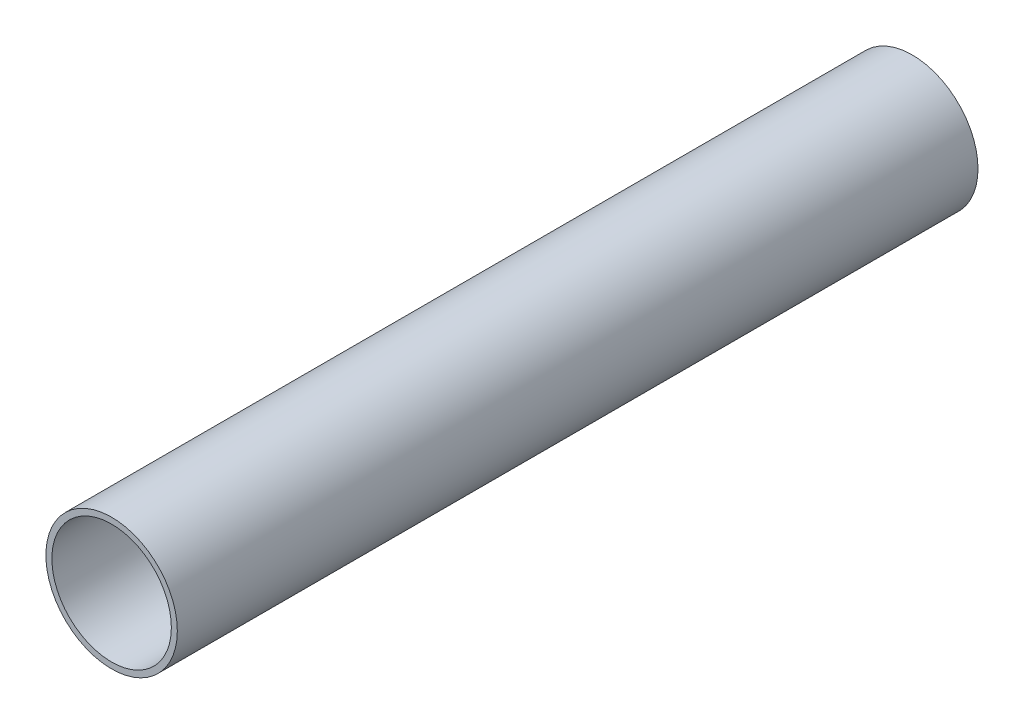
from build123d import *

# Parameters (mm, degrees)
ESQUISSE1_R          = 27.5
ESQUISSE1_R_2        = 25
BASE_EXTRUSION_DEPTH = 335


with BuildPart() as part:
    # Esquisse1 → Base-Extrusion (new body)
    with BuildSketch(Plane.XY):
        Circle(ESQUISSE1_R)
        Circle(ESQUISSE1_R_2, mode=Mode.SUBTRACT)
    extrude(amount=-BASE_EXTRUSION_DEPTH)


solid = part.part
